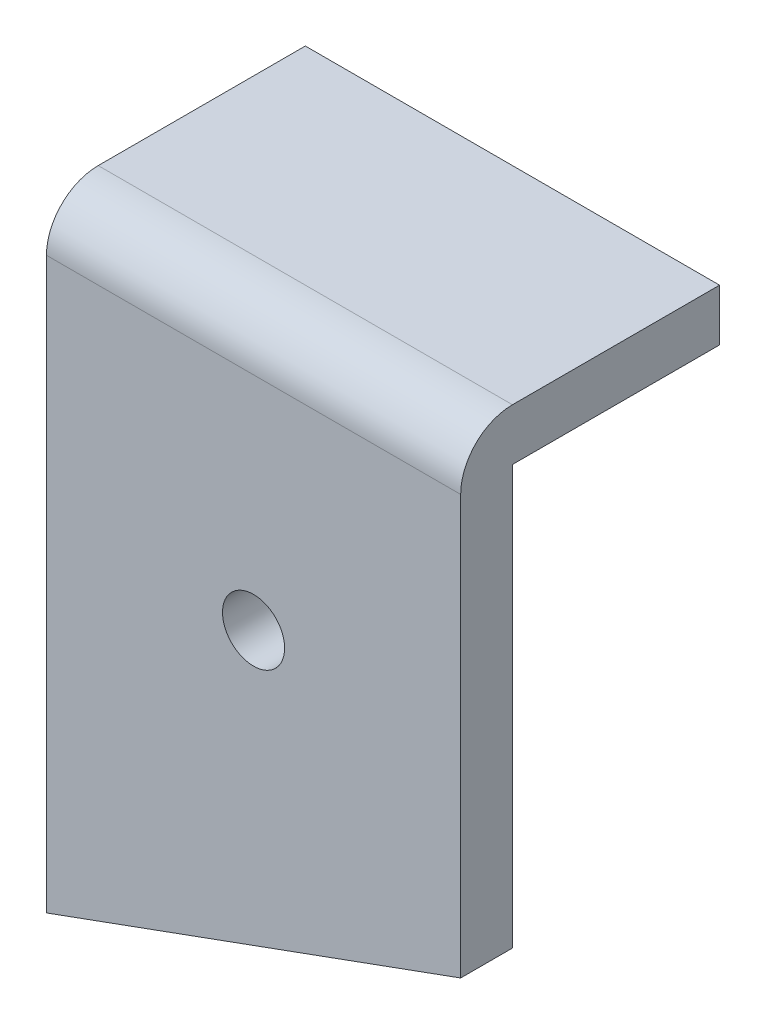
from build123d import *

# Parameters (mm, degrees)
ESQUISSE1_R      = 6
EXTRUSION1_DEPTH = 10
ESQUISSE2_W      = 80
ESQUISSE2_H      = 10
EXTRUSION2_DEPTH = 40
CONG_1_R         = 10


with BuildPart() as part:
    # Esquisse1 → Extrusion1 (new body)
    with BuildSketch(Plane.XY):
        Polygon((0, 0), (80, 0), (80, -90.882381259), (0, -120), align=None)
        with Locations((40, -52.720595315)):
            Circle(ESQUISSE1_R, mode=Mode.SUBTRACT)
    extrude(amount=EXTRUSION1_DEPTH)

    # Esquisse2 → Extrusion2 (add)
    with BuildSketch(Plane(origin=(0, 0, 0), x_dir=(-1, 0, 0), z_dir=(0, 0, -1))):
        with Locations((-40, -5)):
            Rectangle(ESQUISSE2_W, ESQUISSE2_H)
    extrude(amount=EXTRUSION2_DEPTH)

    # Cong_1
    cong_1_edges = [part.edges().sort_by_distance(p)[0] for p in [
        (40, 0, 10),
    ]]
    fillet(cong_1_edges, radius=CONG_1_R)


solid = part.part
